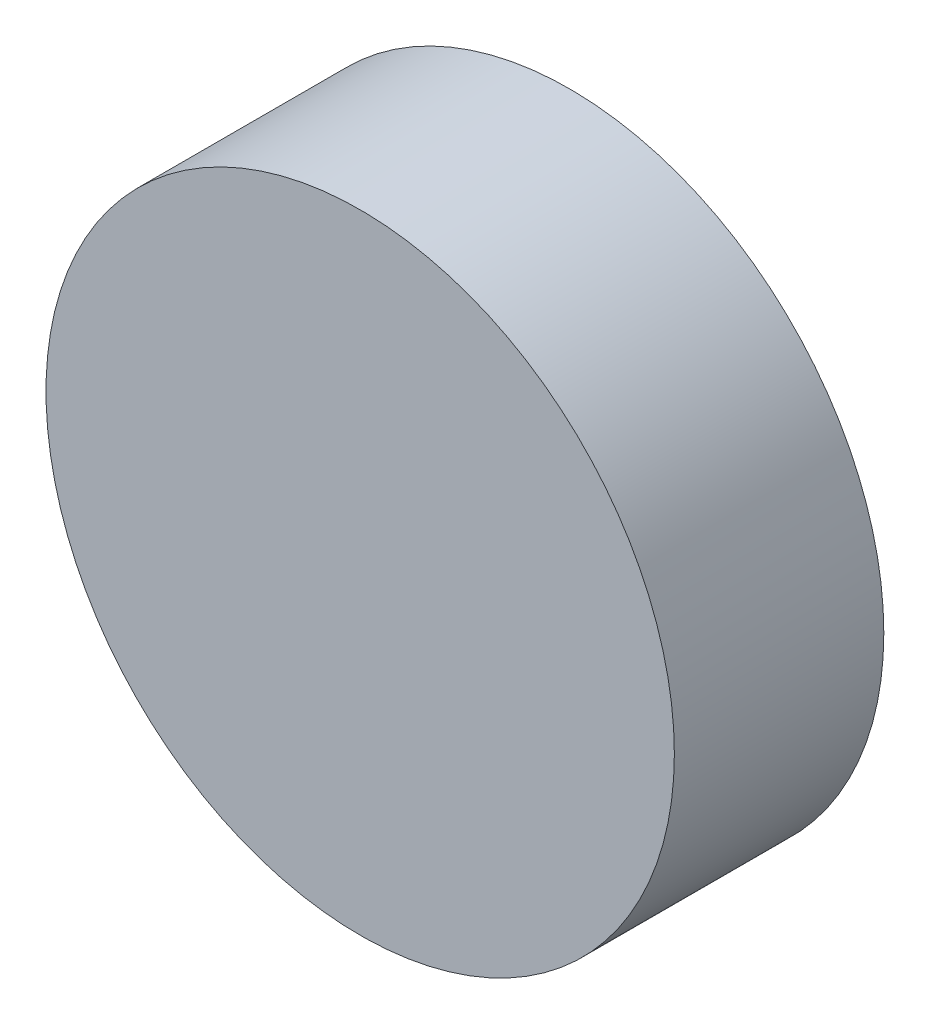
from build123d import *

# Parameters (mm, degrees)
SKETCH1_R           = 4.7625
BOSS_EXTRUDE1_DEPTH = 3.175


with BuildPart() as part:
    # Sketch1 → Boss-Extrude1 (new body)
    with BuildSketch(Plane.XY):
        Circle(SKETCH1_R)
    extrude(amount=-BOSS_EXTRUDE1_DEPTH)


solid = part.part
